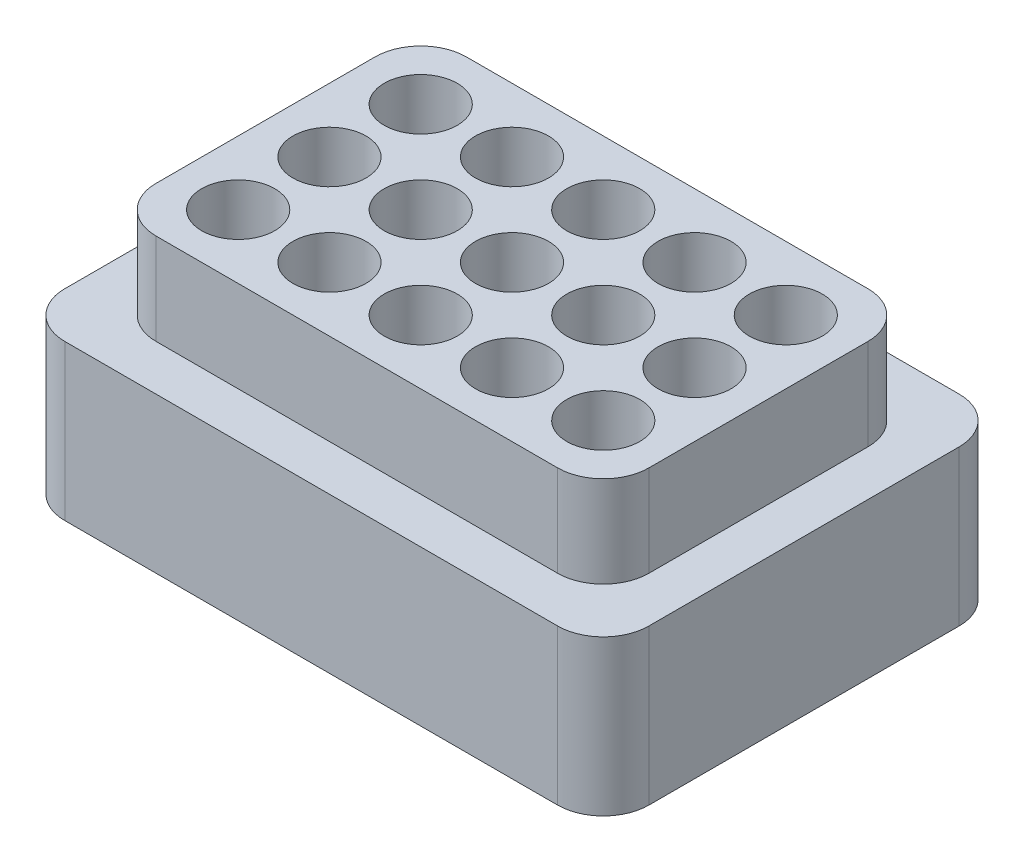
from build123d import *

# Parameters (mm, degrees)
SKETCH_2_W          = 64
SKETCH_2_H          = 44
SKETCH_2_R          = 4
EXTRUDE_1_DEPTH     = 25
SKETCH_4_W          = 64
SKETCH_4_H          = 44
EXTRUDE_2_DEPTH     = 2
SKETCH_5_W          = 64
SKETCH_5_H          = 44
SKETCH_5_W_2        = 54
SKETCH_5_H_2        = 34
CUT_EXTRUDE_1_DEPTH = 10
FILLET_1_R          = 5


with BuildPart() as part:
    # Sketch 2 → Extrude 1 (new body)
    with BuildSketch(Plane(origin=(0, 0, 0), x_dir=(1, 0, 0), z_dir=(0, 1, 0))):
        with Locations((3.185634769, -1.267904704)):
            Rectangle(SKETCH_2_W, SKETCH_2_H)
        with Locations(Location((-16.814365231, 8.732095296, 0), (0, 0, 270))):
            Circle(SKETCH_2_R, mode=Mode.SUBTRACT)
        with Locations(Location((-6.814365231, 8.732095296, 0), (0, 0, 270))):
            Circle(SKETCH_2_R, mode=Mode.SUBTRACT)
        with Locations(Location((3.185634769, 8.732095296, 0), (0, 0, 270))):
            Circle(SKETCH_2_R, mode=Mode.SUBTRACT)
        with Locations(Location((13.185634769, 8.732095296, 0), (0, 0, 270))):
            Circle(SKETCH_2_R, mode=Mode.SUBTRACT)
        with Locations(Location((23.185634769, 8.732095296, 0), (0, 0, 270))):
            Circle(SKETCH_2_R, mode=Mode.SUBTRACT)
        with Locations(Location((-6.814365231, -1.267904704, 0), (0, 0, 270))):
            Circle(SKETCH_2_R, mode=Mode.SUBTRACT)
        with Locations(Location((3.185634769, -1.267904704, 0), (0, 0, 270))):
            Circle(SKETCH_2_R, mode=Mode.SUBTRACT)
        with Locations(Location((13.185634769, -1.267904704, 0), (0, 0, 270))):
            Circle(SKETCH_2_R, mode=Mode.SUBTRACT)
        with Locations(Location((23.185634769, -1.267904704, 0), (0, 0, 270))):
            Circle(SKETCH_2_R, mode=Mode.SUBTRACT)
        with Locations(Location((-6.814365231, -11.267904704, 0), (0, 0, 270))):
            Circle(SKETCH_2_R, mode=Mode.SUBTRACT)
        with Locations(Location((3.185634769, -11.267904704, 0), (0, 0, 270))):
            Circle(SKETCH_2_R, mode=Mode.SUBTRACT)
        with Locations(Location((13.185634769, -11.267904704, 0), (0, 0, 270))):
            Circle(SKETCH_2_R, mode=Mode.SUBTRACT)
        with Locations(Location((23.185634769, -11.267904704, 0), (0, 0, 270))):
            Circle(SKETCH_2_R, mode=Mode.SUBTRACT)
        with Locations(Location((-16.814365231, -1.267904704, 0), (0, 0, 270))):
            Circle(SKETCH_2_R, mode=Mode.SUBTRACT)
        with Locations(Location((-16.814365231, -11.267904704, 0), (0, 0, 270))):
            Circle(SKETCH_2_R, mode=Mode.SUBTRACT)
    extrude(amount=EXTRUDE_1_DEPTH)

    # Sketch 4 → Extrude 2 (add)
    with BuildSketch(Plane.XZ):
        with Locations((3.185634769, 1.267904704)):
            Rectangle(SKETCH_4_W, SKETCH_4_H)
    extrude(amount=EXTRUDE_2_DEPTH)

    # Sketch 5 → Cut-Extrude 1 (cut)
    with BuildSketch(Plane(origin=(0, 25, 0), x_dir=(1, 0, 0), z_dir=(0, 1, 0))):
        with Locations((3.185634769, -1.267904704)):
            Rectangle(SKETCH_5_W, SKETCH_5_H)
        with Locations((3.185634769, -1.267904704)):
            Rectangle(SKETCH_5_W_2, SKETCH_5_H_2, mode=Mode.SUBTRACT)
    extrude(amount=-CUT_EXTRUDE_1_DEPTH, mode=Mode.SUBTRACT)

    # Fillet 1
    fillet_1_edges = [part.edges().sort_by_distance(p)[0] for p in [
        (-28.814365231, 6.5, 23.267904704),
        (35.185634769, 6.5, 23.267904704),
        (-28.814365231, 6.5, -20.732095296),
        (35.185634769, 6.5, -20.732095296),
        (-23.814365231, 20, -15.732095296),
        (30.185634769, 20, -15.732095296),
        (30.185634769, 20, 18.267904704),
        (-23.814365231, 20, 18.267904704),
    ]]
    fillet(fillet_1_edges, radius=FILLET_1_R)


solid = part.part
